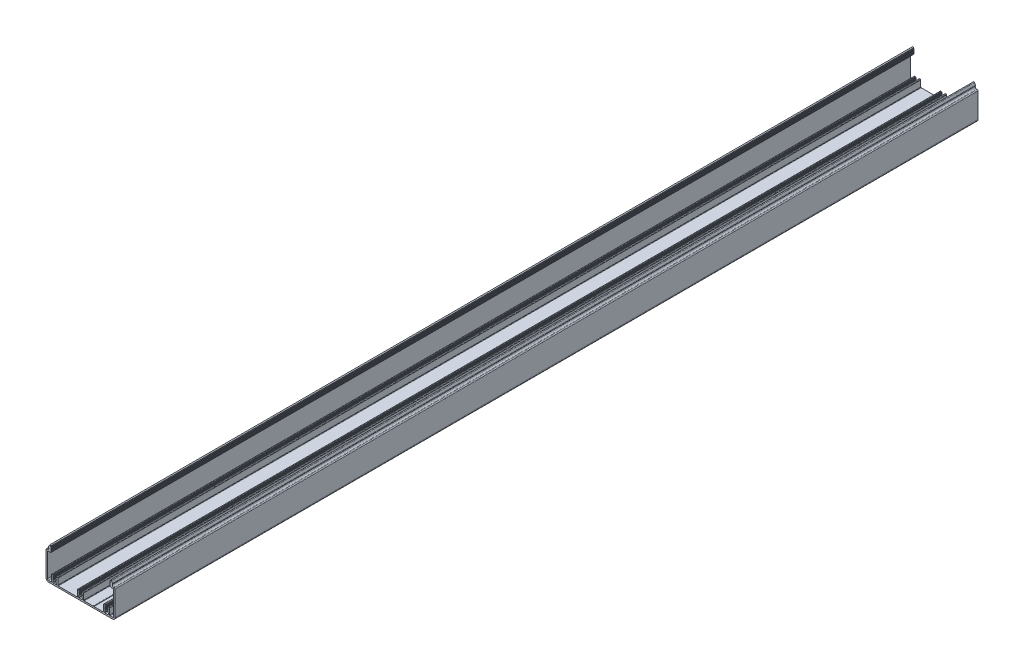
from build123d import *

# Parameters (mm, degrees)
AUFSATZ_LINEAR_AUSTRAGEN1_DEPTH = 1000


with BuildPart() as part:
    # Model → Aufsatz-Linear austragen1 (new body)
    with BuildSketch(Plane.XY):
        with BuildLine():
            Line((137.0091255, -31.885898), (137.5591255, -32.203441))
            Line((137.5591255, -32.203441), (137.5591255, -32.968355))
            Line((137.5591255, -32.968355), (137.0091255, -33.285898))
            Line((137.0091255, -33.285898), (137.5591255, -33.603441))
            Line((137.5591255, -33.603441), (137.5591255, -34.368355))
            Line((137.5591255, -34.368355), (137.0091255, -34.685898))
            Line((137.0091255, -34.685898), (137.5591255, -35.003439))
            Line((137.5591255, -35.003439), (137.5591255, -35.768345))
            Line((137.5591255, -35.768345), (137.0091255, -36.085888))
            Line((137.0091255, -36.085888), (137.5591255, -36.403431))
            Line((137.5591255, -36.403431), (137.5591255, -37.168345))
            Line((137.5591255, -37.168345), (137.0091255, -37.485888))
            Line((137.0091255, -37.485888), (137.0091255, -39.035888))
            ThreePointArc((137.0091255, -39.035888), (137.155572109, -39.389441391), (137.5091255, -39.535888))
            Line((137.5091255, -39.535888), (140.8091135, -39.535888))
            ThreePointArc((140.8091135, -39.535888), (141.162666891, -39.389441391), (141.3091135, -39.035888))
            Line((141.3091135, -39.035888), (141.3091135, -38.185888))
            Line((141.3091135, -38.185888), (140.7591135, -37.868345))
            Line((140.7591135, -37.868345), (140.7591135, -37.103431))
            Line((140.7591135, -37.103431), (141.3091135, -36.785888))
            Line((141.3091135, -36.785888), (140.7591135, -36.468345))
            Line((140.7591135, -36.468345), (140.7591135, -35.703431))
            Line((140.7591135, -35.703431), (141.3091135, -35.385889))
            Line((141.3091135, -35.385889), (140.7591135, -35.068346))
            Line((140.7591135, -35.068346), (140.7591135, -34.303441))
            Line((140.7591135, -34.303441), (141.3091135, -33.985898))
            Line((141.3091135, -33.985898), (140.7591135, -33.668355))
            Line((140.7591135, -33.668355), (140.7591135, -32.903441))
            Line((140.7591135, -32.903441), (141.3091135, -32.585898))
            Line((141.3091135, -32.585898), (140.7591135, -32.268355))
            Line((140.7591135, -32.268355), (140.7591135, -32.035898))
            ThreePointArc((140.7591135, -32.035898), (140.905560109, -31.682344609), (141.2591135, -31.535898))
            Line((141.2591135, -31.535898), (142.3091135, -31.535898))
            ThreePointArc((142.3091135, -31.535898), (142.662666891, -31.682344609), (142.8091135, -32.035898))
            Line((142.8091135, -32.035898), (142.8091135, -39.035888))
            ThreePointArc((142.8091135, -39.035888), (142.955560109, -39.389441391), (143.3091135, -39.535888))
            Line((143.3091135, -39.535888), (153.8127075, -39.535887))
            ThreePointArc((153.8127075, -39.535887), (154.1591175, -39.235888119), (154.5055275, -39.535887))
            Line((154.5055275, -39.535887), (165.0091185, -39.535887))
            ThreePointArc((165.0091185, -39.535887), (165.362671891, -39.389440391), (165.5091185, -39.035887))
            Line((165.5091185, -39.035887), (165.5091185, -32.035898))
            ThreePointArc((165.5091185, -32.035898), (165.655565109, -31.682344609), (166.0091185, -31.535898))
            Line((166.0091185, -31.535898), (167.0591185, -31.535898))
            ThreePointArc((167.0591185, -31.535898), (167.412671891, -31.682344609), (167.5591185, -32.035898))
            Line((167.5591185, -32.035898), (167.5591185, -32.268355))
            Line((167.5591185, -32.268355), (167.0091185, -32.585898))
            Line((167.0091185, -32.585898), (167.5591185, -32.903441))
            Line((167.5591185, -32.903441), (167.5591185, -33.668355))
            Line((167.5591185, -33.668355), (167.0091185, -33.985898))
            Line((167.0091185, -33.985898), (167.5591185, -34.303441))
            Line((167.5591185, -34.303441), (167.5591185, -35.068346))
            Line((167.5591185, -35.068346), (167.0091185, -35.385889))
            Line((167.0091185, -35.385889), (167.5591185, -35.70343))
            Line((167.5591185, -35.70343), (167.5591185, -36.468344))
            Line((167.5591185, -36.468344), (167.0091185, -36.785887))
            Line((167.0091185, -36.785887), (167.5591185, -37.10343))
            Line((167.5591185, -37.10343), (167.5591185, -37.868344))
            Line((167.5591185, -37.868344), (167.0091185, -38.185887))
            Line((167.0091185, -38.185887), (167.0091185, -39.035887))
            ThreePointArc((167.0091185, -39.035887), (167.155565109, -39.389440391), (167.5091185, -39.535887))
            Line((167.5091185, -39.535887), (170.8091085, -39.535887))
            ThreePointArc((170.8091085, -39.535887), (171.162661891, -39.389440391), (171.3091085, -39.035887))
            Line((171.3091085, -39.035887), (171.3091085, -37.485887))
            Line((171.3091085, -37.485887), (170.7591085, -37.168344))
            Line((170.7591085, -37.168344), (170.7591085, -36.40343))
            Line((170.7591085, -36.40343), (171.3091085, -36.085887))
            Line((171.3091085, -36.085887), (170.7591085, -35.768344))
            Line((170.7591085, -35.768344), (170.7591085, -35.003439))
            Line((170.7591085, -35.003439), (171.3091085, -34.685898))
            Line((171.3091085, -34.685898), (170.7591085, -34.368355))
            Line((170.7591085, -34.368355), (170.7591085, -33.603441))
            Line((170.7591085, -33.603441), (171.3091085, -33.285898))
            Line((171.3091085, -33.285898), (170.7591085, -32.968355))
            Line((170.7591085, -32.968355), (170.7591085, -32.203441))
            Line((170.7591085, -32.203441), (171.3091085, -31.885898))
            Line((171.3091085, -31.885898), (171.3091085, -31.5358965))
            Line((171.3091085, -31.5358965), (172.3091085, -31.5358965))
            ThreePointArc((172.3091085, -31.5358965), (172.662661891, -31.682343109), (172.8091085, -32.0358965))
            Line((172.8091085, -32.0358965), (172.8091085, -39.0358855))
            ThreePointArc((172.8091085, -39.0358855), (172.95555617, -39.389439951), (173.3091115, -39.5358855))
            Line((173.3091115, -39.5358855), (176.1590955, -39.5358865))
            ThreePointArc((176.1590955, -39.5358865), (177.00762393, -39.184415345), (177.3590965, -38.3358875))
            Line((177.3590965, -38.3358875), (177.3591265, -10.8358905))
            ThreePointArc((177.3591265, -10.8358905), (177.212680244, -10.482336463), (176.8591265, -10.3358895))
            Line((176.8591265, -10.3358895), (173.6601995, -10.3358915))
            Line((173.6601995, -10.3358915), (173.6600485, -9.8864385))
            Line((173.6600485, -9.8864385), (173.1091125, -9.5683565))
            Line((173.1091125, -9.5683565), (173.1091125, -8.8034425))
            Line((173.1091125, -8.8034425), (173.6591125, -8.4858995))
            Line((173.6591125, -8.4858995), (173.1091125, -8.1683565))
            Line((173.1091125, -8.1683565), (173.1091125, -7.4034425))
            Line((173.1091125, -7.4034425), (173.6591125, -7.0858995))
            Line((173.6591125, -7.0858995), (173.1091125, -6.7683595))
            Line((173.1091125, -6.7683595), (173.1091125, -6.0034525))
            Line((173.1091125, -6.0034525), (173.6591125, -5.6859105))
            Line((173.6591125, -5.6859105), (173.1091125, -5.3683675))
            Line((173.1091125, -5.3683675), (173.1091125, -4.6034535))
            Line((173.1091125, -4.6034535), (173.6657655, -4.2820695))
            Line((173.6657655, -4.2820695), (173.6657755, -3.7877255))
            ThreePointArc((173.6657755, -3.7877255), (174.223039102, -3.061509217), (175.0687445, -3.4118165))
            Line((175.0687445, -3.4118165), (176.2251555, -5.4147785))
            ThreePointArc((176.2251555, -5.4147785), (176.358888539, -5.936825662), (176.202274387, -6.452470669))
            ThreePointArc((176.202274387, -6.452470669), (176.150046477, -8.031106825), (177.5091435, -8.8358895))
            Line((177.5091435, -8.8358895), (178.1591255, -8.8358885))
            ThreePointArc((178.1591255, -8.8358885), (178.866233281, -9.128781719), (179.1591265, -9.8358895))
            Line((179.1591265, -9.8358895), (179.1590965, -38.3358865))
            ThreePointArc((179.1590965, -38.3358865), (178.280420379, -40.457203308), (176.1591065, -41.3358865))
            Line((176.1591065, -41.3358865), (102.1591195, -41.3358865))
            ThreePointArc((102.1591195, -41.3358865), (100.037798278, -40.457208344), (99.159118, -38.335888))
            Line((99.159118, -38.335888), (99.159117, -9.83589))
            ThreePointArc((99.159117, -9.83589), (99.452010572, -9.128781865), (100.159119, -8.835889))
            Line((100.159119, -8.835889), (100.809101, -8.83589))
            ThreePointArc((100.809101, -8.83589), (102.168200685, -8.031107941), (102.115972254, -6.452469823))
            ThreePointArc((102.115972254, -6.452469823), (101.959357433, -5.936825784), (102.093089, -5.414779))
            Line((102.093089, -5.414779), (103.249498, -3.411819))
            ThreePointArc((103.249498, -3.411819), (104.095205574, -3.0615073), (104.6524695, -3.787728))
            Line((104.6524695, -3.787728), (104.6524785, -4.282065))
            Line((104.6524785, -4.282065), (105.2091295, -4.603447))
            Line((105.2091295, -4.603447), (105.2091295, -5.368361))
            Line((105.2091295, -5.368361), (104.6591295, -5.685904))
            Line((104.6591295, -5.685904), (105.2091295, -6.003446))
            Line((105.2091295, -6.003446), (105.2091295, -6.768353))
            Line((105.2091295, -6.768353), (104.6591295, -7.085893))
            Line((104.6591295, -7.085893), (105.2091295, -7.403436))
            Line((105.2091295, -7.403436), (105.2091295, -8.16835))
            Line((105.2091295, -8.16835), (104.6591295, -8.485893))
            Line((104.6591295, -8.485893), (105.2091295, -8.803436))
            Line((105.2091295, -8.803436), (105.2091295, -9.56835))
            Line((105.2091295, -9.56835), (104.6581935, -9.886432))
            Line((104.6581935, -9.886432), (104.6580425, -10.335893))
            Line((104.6580425, -10.335893), (101.4591185, -10.335891))
            ThreePointArc((101.4591185, -10.335891), (101.105565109, -10.482337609), (100.9591185, -10.835891))
            Line((100.9591185, -10.835891), (100.9591165, -38.335888))
            ThreePointArc((100.9591165, -38.335888), (101.310588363, -39.184416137), (102.1591165, -39.535888))
            Line((102.1591165, -39.535888), (105.0091265, -39.535887))
            ThreePointArc((105.0091265, -39.535887), (105.362679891, -39.389440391), (105.5091265, -39.035887))
            Line((105.5091265, -39.035887), (105.5091265, -32.035898))
            ThreePointArc((105.5091265, -32.035898), (105.655573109, -31.682344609), (106.0091265, -31.535898))
            Line((106.0091265, -31.535898), (107.0091265, -31.535898))
            Line((107.0091265, -31.535898), (107.0091265, -31.885898))
            Line((107.0091265, -31.885898), (107.5591265, -32.203441))
            Line((107.5591265, -32.203441), (107.5591265, -32.968355))
            Line((107.5591265, -32.968355), (107.0091265, -33.285898))
            Line((107.0091265, -33.285898), (107.5591265, -33.603441))
            Line((107.5591265, -33.603441), (107.5591265, -34.368355))
            Line((107.5591265, -34.368355), (107.0091265, -34.685898))
            Line((107.0091265, -34.685898), (107.5591265, -35.003439))
            Line((107.5591265, -35.003439), (107.5591265, -35.768344))
            Line((107.5591265, -35.768344), (107.0091265, -36.085887))
            Line((107.0091265, -36.085887), (107.5591265, -36.40343))
            Line((107.5591265, -36.40343), (107.5591265, -37.168344))
            Line((107.5591265, -37.168344), (107.0091265, -37.485887))
            Line((107.0091265, -37.485887), (107.0091265, -39.035887))
            ThreePointArc((107.0091265, -39.035887), (107.155573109, -39.389440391), (107.5091265, -39.535887))
            Line((107.5091265, -39.535887), (110.8091155, -39.535887))
            ThreePointArc((110.8091155, -39.535887), (111.162668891, -39.389440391), (111.3091155, -39.035887))
            Line((111.3091155, -39.035887), (111.3091155, -38.185887))
            Line((111.3091155, -38.185887), (110.7591155, -37.868344))
            Line((110.7591155, -37.868344), (110.7591155, -37.10343))
            Line((110.7591155, -37.10343), (111.3091155, -36.785887))
            Line((111.3091155, -36.785887), (110.7591155, -36.468344))
            Line((110.7591155, -36.468344), (110.7591155, -35.70343))
            Line((110.7591155, -35.70343), (111.3091155, -35.385889))
            Line((111.3091155, -35.385889), (110.7591155, -35.068346))
            Line((110.7591155, -35.068346), (110.7591155, -34.303441))
            Line((110.7591155, -34.303441), (111.3091155, -33.985898))
            Line((111.3091155, -33.985898), (110.7591155, -33.668355))
            Line((110.7591155, -33.668355), (110.7591155, -32.903441))
            Line((110.7591155, -32.903441), (111.3091155, -32.585898))
            Line((111.3091155, -32.585898), (110.7591155, -32.268355))
            Line((110.7591155, -32.268355), (110.7591155, -32.035898))
            ThreePointArc((110.7591155, -32.035898), (110.905562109, -31.682344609), (111.2591155, -31.535898))
            Line((111.2591155, -31.535898), (112.3091155, -31.535898))
            ThreePointArc((112.3091155, -31.535898), (112.662668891, -31.682344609), (112.8091155, -32.035898))
            Line((112.8091155, -32.035898), (112.8091155, -39.035887))
            ThreePointArc((112.8091155, -39.035887), (112.955562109, -39.389440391), (113.3091155, -39.535887))
            Line((113.3091155, -39.535887), (135.0091245, -39.535888))
            ThreePointArc((135.0091245, -39.535888), (135.362678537, -39.389441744), (135.5091255, -39.035888))
            Line((135.5091255, -39.035888), (135.5091255, -32.035898))
            ThreePointArc((135.5091255, -32.035898), (135.655572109, -31.682344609), (136.0091255, -31.535898))
            Line((136.0091255, -31.535898), (137.0091255, -31.535898))
            Line((137.0091255, -31.535898), (137.0091255, -31.885898))
        make_face()
    extrude(amount=AUFSATZ_LINEAR_AUSTRAGEN1_DEPTH)


solid = part.part
